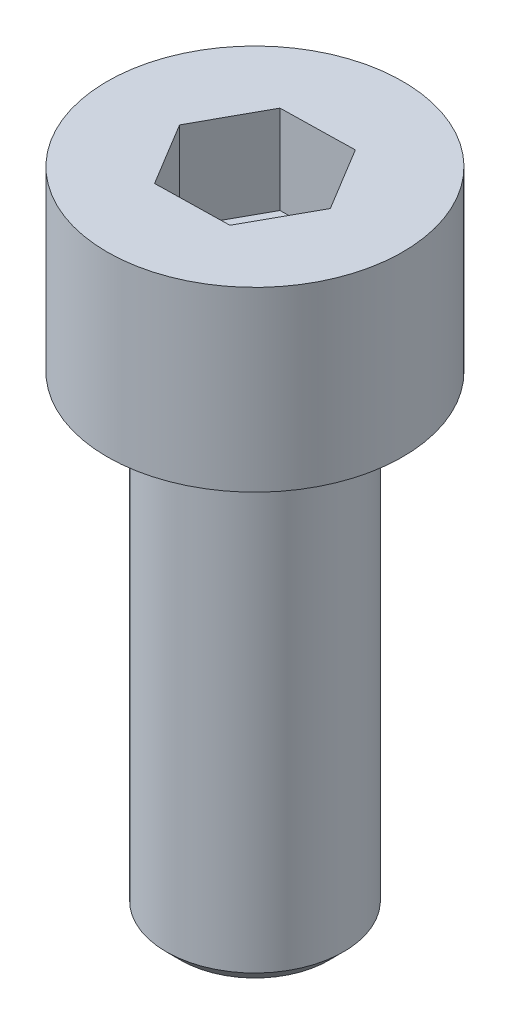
from build123d import *

# Parameters (mm, degrees)
ENL_V_MAT_EXTRU_1_DEPTH = 3


with BuildPart() as part:
    # Esquisse1 → Base-R_volution (revolve)
    with BuildSketch(Plane.XY, mode=Mode.PRIVATE) as base_r_volution_sk:
        Polygon((3, 0), (5, 0), (5, 6), (0, 6), (0, -16), (2.5, -16), (3, -15.5), align=None)
    revolve(base_r_volution_sk.sketch.rotate(Axis((0, 7.546181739, 0), (0, -1, 0)), 90), axis=Axis((0, 7.546181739, 0), (0, -1, 0)))

    # hexagon1 → Enl_v. mat.-Extru.1 (cut)
    with BuildSketch(Plane(origin=(-1.207472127, 6, -1.102470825), x_dir=(-1, 0, 0), z_dir=(0, 1, 0))):
        Polygon((1.292024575, 1.152632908), (-0.001165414, 3.292179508), (-2.500662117, 3.242017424), (-3.70696883, 1.052308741), (-2.41377884, -1.087237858), (0.085717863, -1.037075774), align=None)
    extrude(amount=-ENL_V_MAT_EXTRU_1_DEPTH, mode=Mode.SUBTRACT)


solid = part.part
